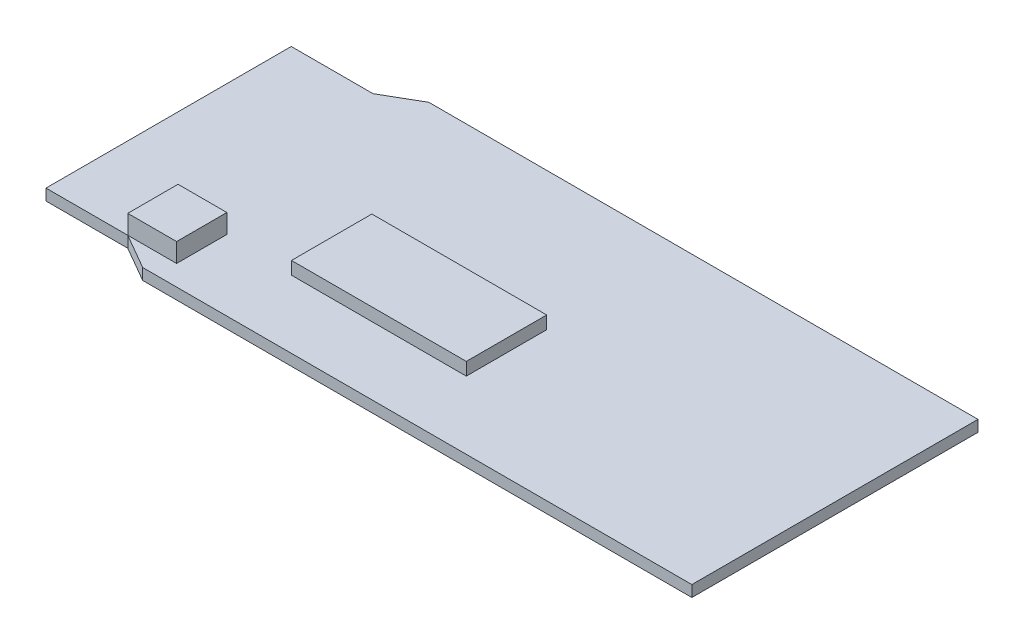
from build123d import *

# Parameters (mm, degrees)
EXTRUDE1_DEPTH = 1.397
SKETCH3_W      = 6.0706
SKETCH3_H      = 6.2484
EXTRUDE2_DEPTH = 2.3622
SKETCH4_W      = 21.727112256
SKETCH4_H      = 9.992773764
EXTRUDE4_DEPTH = 1.5875


with BuildPart() as part:
    # Sketch1 → Extrude1 (new body)
    with BuildSketch(Plane(origin=(0, 0, 0), x_dir=(1, 0, 0), z_dir=(0, 1, 0))):
        Polygon((10.16, 33.02), (0, 33.02), (0, 2.54), (10.16, 2.54), (14.559409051, 0), (82.804, 0), (82.804, 35.56), (14.559409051, 35.56), align=None)
    extrude(amount=EXTRUDE1_DEPTH)

    # Sketch3 → Extrude2 (add)
    with BuildSketch(Plane(origin=(0, 1.397, 0), x_dir=(-1, 0, 0), z_dir=(0, 1, 0))):
        with Locations((-13.1953, -5.6642)):
            Rectangle(SKETCH3_W, SKETCH3_H)
    extrude(amount=EXTRUDE2_DEPTH)

    # Sketch4 → Extrude4 (add)
    with BuildSketch(Plane(origin=(0, 1.397, 0), x_dir=(-1, 0, 0), z_dir=(0, 1, 0))):
        with Locations((-35.492225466, -13.412181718)):
            Rectangle(SKETCH4_W, SKETCH4_H)
    extrude(amount=EXTRUDE4_DEPTH)


solid = part.part
